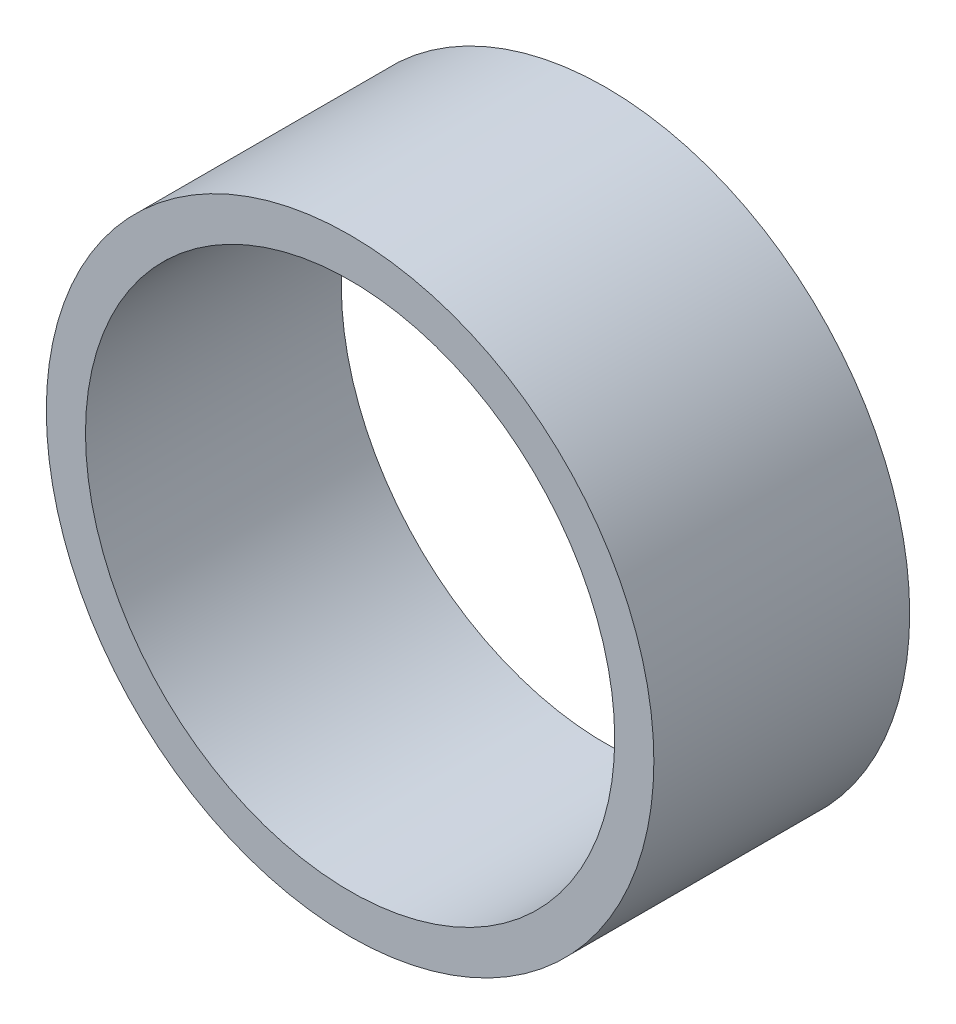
from build123d import *

# Parameters (mm, degrees)
SKETCH2_R           = 9.5
SKETCH2_R_2         = 8.275
BOSS_EXTRUDE2_DEPTH = 8


with BuildPart() as part:
    # Sketch2 → Boss-Extrude2 (new body)
    with BuildSketch(Plane(origin=(0, 0, 0), x_dir=(0, 1, 0), z_dir=(0, 0, 1))):
        with Locations(Location((0, 0, 0), (0, 0, 270))):
            Circle(SKETCH2_R)
        with Locations(Location((0, 0, 0), (0, 0, 270))):
            Circle(SKETCH2_R_2, mode=Mode.SUBTRACT)
    extrude(amount=-BOSS_EXTRUDE2_DEPTH)


solid = part.part
